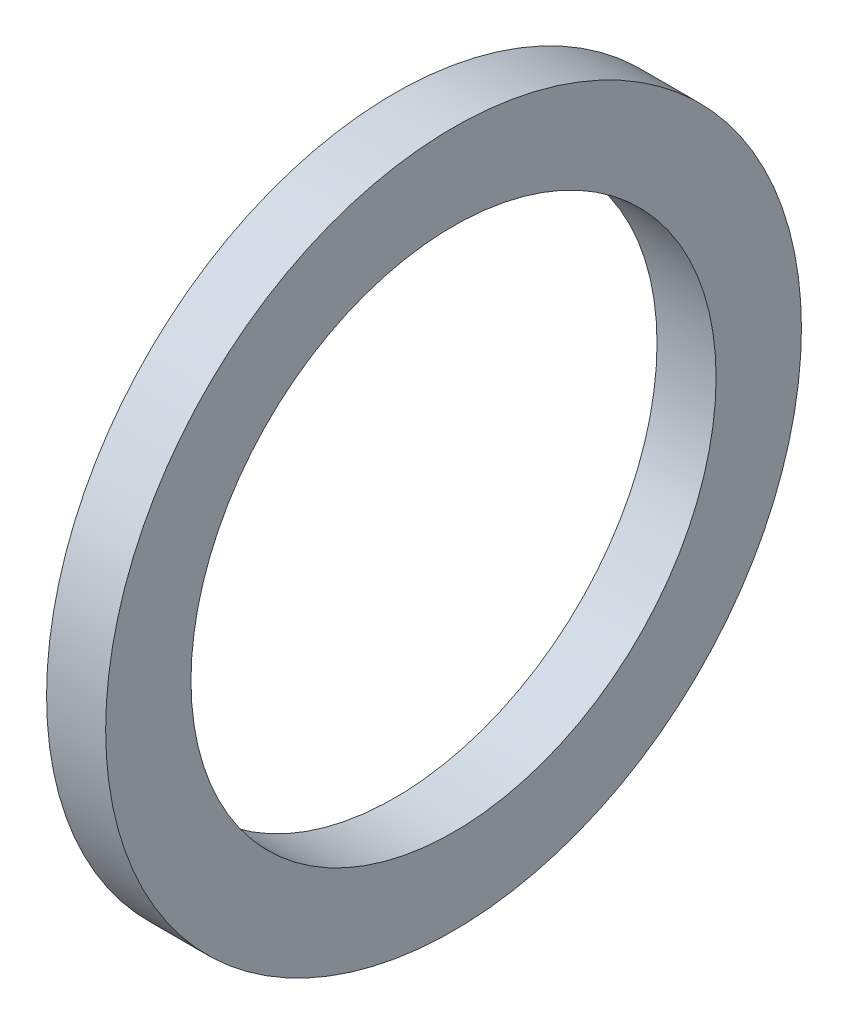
from build123d import *

# Parameters (mm, degrees)
SKETCH1_R           = 5.3
SKETCH1_R_2         = 4
BOSS_EXTRUDE1_DEPTH = 0.45


with BuildPart() as part:
    # Sketch1 → Boss-Extrude1 (new, symmetric)
    with BuildSketch(Plane(origin=(0, 0, 0), x_dir=(0, 0, -1), z_dir=(1, 0, 0))):
        Circle(SKETCH1_R)
        Circle(SKETCH1_R_2, mode=Mode.SUBTRACT)
    extrude(amount=BOSS_EXTRUDE1_DEPTH, both=True)


solid = part.part
